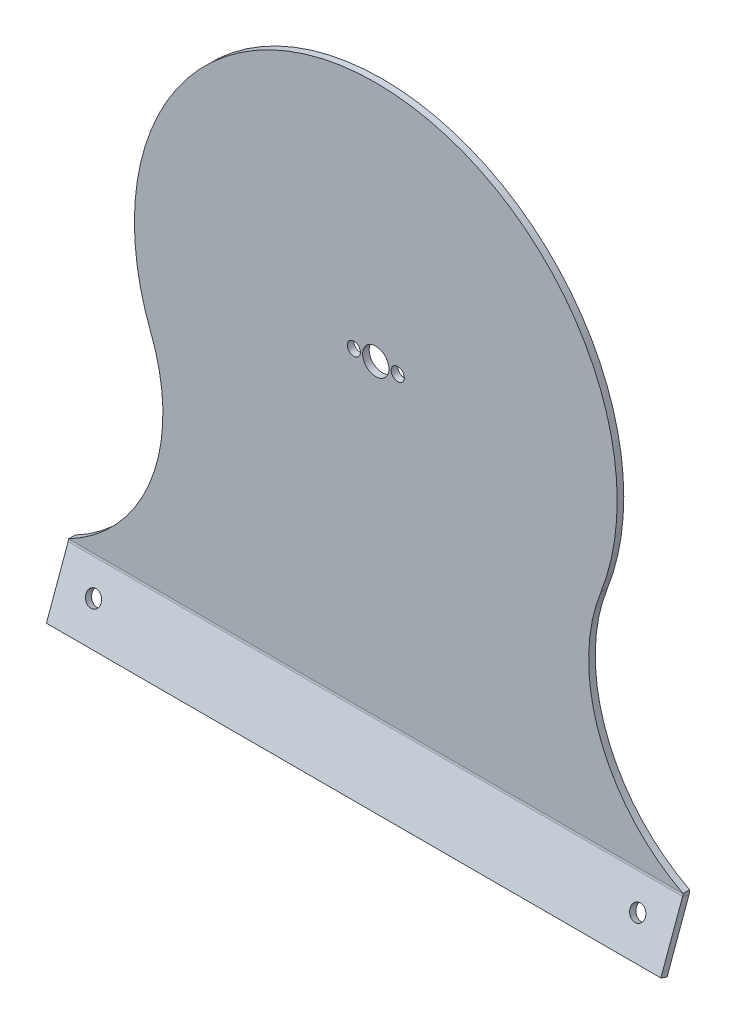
ISO-10303-21;
HEADER;
FILE_DESCRIPTION(('STEP AP214'),'2;1');
FILE_NAME('part.step','',(''),(''),'','','');
FILE_SCHEMA(('AUTOMOTIVE_DESIGN { 1 0 10303 214 1 1 1 1 }'));
ENDSEC;
DATA;
#1=APPLICATION_CONTEXT('core data for automotive mechanical design processes');
#2=APPLICATION_PROTOCOL_DEFINITION('international standard','automotive_design',2000,#1);
#3=PRODUCT_CONTEXT('',#1,'mechanical');
#4=PRODUCT('Part','Part','',(#3));
#5=PRODUCT_RELATED_PRODUCT_CATEGORY('part','',(#4));
#6=PRODUCT_DEFINITION_FORMATION('','',#4);
#7=PRODUCT_DEFINITION_CONTEXT('part definition',#1,'design');
#8=PRODUCT_DEFINITION('design','',#6,#7);
#9=PRODUCT_DEFINITION_SHAPE('','',#8);
#10=(LENGTH_UNIT() NAMED_UNIT(*) SI_UNIT(.MILLI.,.METRE.));
#11=(NAMED_UNIT(*) PLANE_ANGLE_UNIT() SI_UNIT($,.RADIAN.));
#12=(NAMED_UNIT(*) SI_UNIT($,.STERADIAN.) SOLID_ANGLE_UNIT());
#13=UNCERTAINTY_MEASURE_WITH_UNIT(LENGTH_MEASURE(1.E-05),#10,'distance_accuracy_value','');
#14=(GEOMETRIC_REPRESENTATION_CONTEXT(3) GLOBAL_UNCERTAINTY_ASSIGNED_CONTEXT((#13)) GLOBAL_UNIT_ASSIGNED_CONTEXT((#10,
#11,#12)) REPRESENTATION_CONTEXT('',''));
#15=CARTESIAN_POINT('',(0.,0.,0.));
#16=DIRECTION('',(0.,0.,1.));
#17=DIRECTION('',(1.,0.,0.));
#18=AXIS2_PLACEMENT_3D('',#15,#16,#17);
#19=CARTESIAN_POINT('',(70.,-69.1034912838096,1.07743085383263));
#20=DIRECTION('',(1.,0.,0.));
#21=DIRECTION('',(0.,-0.342020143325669,-0.939692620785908));
#22=AXIS2_PLACEMENT_3D('',#19,#20,#21);
#23=PLANE('',#22);
#24=DIRECTION('',(0.,-0.939692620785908,0.342020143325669));
#25=VECTOR('',#24,1.);
#26=CARTESIAN_POINT('',(70.,-69.6165214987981,-0.332108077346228));
#27=LINE('',#26,#25);
#28=CARTESIAN_POINT('',(70.,-71.026060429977,0.180922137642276));
#29=VERTEX_POINT('',#28);
#30=CARTESIAN_POINT('',(70.,-84.6516034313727,5.14021421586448));
#31=VERTEX_POINT('',#30);
#32=EDGE_CURVE('E60',#29,#31,#27,.T.);
#33=ORIENTED_EDGE('',*,*,#32,.F.);
#34=DIRECTION('',(0.,0.342020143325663,0.939692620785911));
#35=VECTOR('',#34,1.);
#36=CARTESIAN_POINT('',(70.,-70.5130302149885,1.59046106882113));
#37=LINE('',#36,#35);
#38=CARTESIAN_POINT('',(70.,-70.5130302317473,1.59046102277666));
#39=VERTEX_POINT('',#38);
#40=EDGE_CURVE('E171',#29,#39,#37,.T.);
#41=ORIENTED_EDGE('',*,*,#40,.T.);
#42=DIRECTION('',(0.,-0.939692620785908,0.342020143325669));
#43=VECTOR('',#42,1.);
#44=CARTESIAN_POINT('',(70.,-69.1034912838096,1.07743085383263));
#45=LINE('',#44,#43);
#46=CARTESIAN_POINT('',(70.,-84.1385732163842,6.54975314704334));
#47=VERTEX_POINT('',#46);
#48=EDGE_CURVE('E40',#39,#47,#45,.T.);
#49=ORIENTED_EDGE('',*,*,#48,.T.);
#50=DIRECTION('',(0.,-0.342020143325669,-0.939692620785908));
#51=VECTOR('',#50,1.);
#52=CARTESIAN_POINT('',(70.,-84.1385732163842,6.54975314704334));
#53=LINE('',#52,#51);
#54=EDGE_CURVE('E164',#47,#31,#53,.T.);
#55=ORIENTED_EDGE('',*,*,#54,.T.);
#56=EDGE_LOOP('',(#33,#41,#49,#55));
#57=FACE_BOUND('',#56,.T.);
#58=ADVANCED_FACE('F36',(#57),#23,.T.);
#59=CARTESIAN_POINT('',(-70.,-84.1385732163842,6.54975314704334));
#60=DIRECTION('',(-1.,0.,0.));
#61=DIRECTION('',(0.,0.342020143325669,0.939692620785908));
#62=AXIS2_PLACEMENT_3D('',#59,#60,#61);
#63=PLANE('',#62);
#64=DIRECTION('',(0.,0.939692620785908,-0.342020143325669));
#65=VECTOR('',#64,1.);
#66=CARTESIAN_POINT('',(-70.,-84.1385732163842,6.54975314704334));
#67=LINE('',#66,#65);
#68=CARTESIAN_POINT('',(-70.,-84.1385732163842,6.54975314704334));
#69=VERTEX_POINT('',#68);
#70=CARTESIAN_POINT('',(-70.,-70.5130302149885,1.59046106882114));
#71=VERTEX_POINT('',#70);
#72=EDGE_CURVE('E160',#69,#71,#67,.T.);
#73=ORIENTED_EDGE('',*,*,#72,.T.);
#74=DIRECTION('',(0.,-0.342020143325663,-0.939692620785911));
#75=VECTOR('',#74,1.);
#76=CARTESIAN_POINT('',(-70.,-70.5130302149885,1.59046106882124));
#77=LINE('',#76,#75);
#78=CARTESIAN_POINT('',(-70.,-71.0260604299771,0.18092213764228));
#79=VERTEX_POINT('',#78);
#80=EDGE_CURVE('E12',#71,#79,#77,.T.);
#81=ORIENTED_EDGE('',*,*,#80,.T.);
#82=DIRECTION('',(0.,0.939692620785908,-0.342020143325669));
#83=VECTOR('',#82,1.);
#84=CARTESIAN_POINT('',(-70.,-84.6516034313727,5.14021421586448));
#85=LINE('',#84,#83);
#86=CARTESIAN_POINT('',(-70.,-84.6516034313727,5.14021421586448));
#87=VERTEX_POINT('',#86);
#88=EDGE_CURVE('E53',#87,#79,#85,.T.);
#89=ORIENTED_EDGE('',*,*,#88,.F.);
#90=DIRECTION('',(0.,-0.342020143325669,-0.939692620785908));
#91=VECTOR('',#90,1.);
#92=CARTESIAN_POINT('',(-70.,-84.1385732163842,6.54975314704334));
#93=LINE('',#92,#91);
#94=EDGE_CURVE('E165',#69,#87,#93,.T.);
#95=ORIENTED_EDGE('',*,*,#94,.F.);
#96=EDGE_LOOP('',(#73,#81,#89,#95));
#97=FACE_BOUND('',#96,.T.);
#98=ADVANCED_FACE('F38',(#97),#63,.T.);
#99=CARTESIAN_POINT('',(-88.5003190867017,-36.2906940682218,-12.4617172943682));
#100=DIRECTION('',(0.,-0.342020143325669,-0.939692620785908));
#101=DIRECTION('',(-1.,0.,0.));
#102=AXIS2_PLACEMENT_3D('',#99,#100,#101);
#103=PLANE('',#102);
#104=CARTESIAN_POINT('',(62.,-77.1340624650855,2.40405306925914));
#105=DIRECTION('',(0.,-0.342020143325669,-0.939692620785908));
#106=DIRECTION('',(-1.,0.,0.));
#107=AXIS2_PLACEMENT_3D('',#104,#105,#106);
#108=CIRCLE('',#107,1.75);
#109=CARTESIAN_POINT('',(60.25,-77.1340624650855,2.40405306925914));
#110=VERTEX_POINT('',#109);
#111=EDGE_CURVE('E146',#110,#110,#108,.T.);
#112=ORIENTED_EDGE('',*,*,#111,.F.);
#113=EDGE_LOOP('',(#112));
#114=FACE_BOUND('',#113,.T.);
#115=CARTESIAN_POINT('',(-62.,-77.1340624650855,2.40405306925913));
#116=DIRECTION('',(0.,-0.342020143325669,-0.939692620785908));
#117=DIRECTION('',(-1.,0.,0.));
#118=AXIS2_PLACEMENT_3D('',#115,#116,#117);
#119=CIRCLE('',#118,1.74999999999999);
#120=CARTESIAN_POINT('',(-63.75,-77.1340624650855,2.40405306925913));
#121=VERTEX_POINT('',#120);
#122=EDGE_CURVE('E152',#121,#121,#119,.T.);
#123=ORIENTED_EDGE('',*,*,#122,.F.);
#124=EDGE_LOOP('',(#123));
#125=FACE_BOUND('',#124,.T.);
#126=ORIENTED_EDGE('',*,*,#88,.T.);
#127=DIRECTION('',(1.,0.,0.));
#128=VECTOR('',#127,1.);
#129=CARTESIAN_POINT('',(-88.5003190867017,-71.0260604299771,0.180922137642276));
#130=LINE('',#129,#128);
#131=EDGE_CURVE('E45',#79,#29,#130,.T.);
#132=ORIENTED_EDGE('',*,*,#131,.T.);
#133=ORIENTED_EDGE('',*,*,#32,.T.);
#134=DIRECTION('',(-1.,0.,0.));
#135=VECTOR('',#134,1.);
#136=CARTESIAN_POINT('',(70.,-84.6516034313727,5.14021421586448));
#137=LINE('',#136,#135);
#138=EDGE_CURVE('E158',#31,#87,#137,.T.);
#139=ORIENTED_EDGE('',*,*,#138,.T.);
#140=EDGE_LOOP('',(#126,#132,#133,#139));
#141=FACE_BOUND('',#140,.T.);
#142=ADVANCED_FACE('F176',(#114,#125,#141),#103,.T.);
#143=CARTESIAN_POINT('',(-88.5003190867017,-35.7776638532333,-11.0521783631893));
#144=DIRECTION('',(0.,-0.342020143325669,-0.939692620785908));
#145=DIRECTION('',(-1.,0.,0.));
#146=AXIS2_PLACEMENT_3D('',#143,#144,#145);
#147=PLANE('',#146);
#148=DIRECTION('',(1.,0.,0.));
#149=VECTOR('',#148,1.);
#150=CARTESIAN_POINT('',(-88.5003190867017,-70.5130302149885,1.59046106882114));
#151=LINE('',#150,#149);
#152=EDGE_CURVE('E167',#71,#39,#151,.T.);
#153=ORIENTED_EDGE('',*,*,#152,.F.);
#154=ORIENTED_EDGE('',*,*,#72,.F.);
#155=DIRECTION('',(-1.,0.,0.));
#156=VECTOR('',#155,1.);
#157=CARTESIAN_POINT('',(70.,-84.1385732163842,6.54975314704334));
#158=LINE('',#157,#156);
#159=EDGE_CURVE('E161',#47,#69,#158,.T.);
#160=ORIENTED_EDGE('',*,*,#159,.F.);
#161=ORIENTED_EDGE('',*,*,#48,.F.);
#162=EDGE_LOOP('',(#153,#154,#160,#161));
#163=FACE_BOUND('',#162,.T.);
#164=CARTESIAN_POINT('',(62.,-76.6210322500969,3.813592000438));
#165=DIRECTION('',(0.,-0.342020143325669,-0.939692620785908));
#166=DIRECTION('',(-1.,0.,0.));
#167=AXIS2_PLACEMENT_3D('',#164,#165,#166);
#168=CIRCLE('',#167,1.75);
#169=CARTESIAN_POINT('',(60.25,-76.6210322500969,3.813592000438));
#170=VERTEX_POINT('',#169);
#171=EDGE_CURVE('E149',#170,#170,#168,.T.);
#172=ORIENTED_EDGE('',*,*,#171,.T.);
#173=EDGE_LOOP('',(#172));
#174=FACE_BOUND('',#173,.T.);
#175=CARTESIAN_POINT('',(-62.,-76.6210322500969,3.81359200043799));
#176=DIRECTION('',(0.,-0.342020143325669,-0.939692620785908));
#177=DIRECTION('',(-1.,0.,0.));
#178=AXIS2_PLACEMENT_3D('',#175,#176,#177);
#179=CIRCLE('',#178,1.74999999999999);
#180=CARTESIAN_POINT('',(-63.75,-76.6210322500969,3.81359200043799));
#181=VERTEX_POINT('',#180);
#182=EDGE_CURVE('E155',#181,#181,#179,.T.);
#183=ORIENTED_EDGE('',*,*,#182,.T.);
#184=EDGE_LOOP('',(#183));
#185=FACE_BOUND('',#184,.T.);
#186=ADVANCED_FACE('F256',(#163,#174,#185),#147,.F.);
#187=CARTESIAN_POINT('',(70.,-84.1385732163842,6.54975314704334));
#188=DIRECTION('',(0.,-0.939692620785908,0.342020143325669));
#189=DIRECTION('',(0.,-0.342020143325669,-0.939692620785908));
#190=AXIS2_PLACEMENT_3D('',#187,#188,#189);
#191=PLANE('',#190);
#192=ORIENTED_EDGE('',*,*,#138,.F.);
#193=ORIENTED_EDGE('',*,*,#54,.F.);
#194=ORIENTED_EDGE('',*,*,#159,.T.);
#195=ORIENTED_EDGE('',*,*,#94,.T.);
#196=EDGE_LOOP('',(#192,#193,#194,#195));
#197=FACE_BOUND('',#196,.T.);
#198=ADVANCED_FACE('F183',(#197),#191,.T.);
#199=CARTESIAN_POINT('',(-62.,-76.6210322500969,3.81359200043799));
#200=DIRECTION('',(0.,-0.342020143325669,-0.939692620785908));
#201=DIRECTION('',(-1.,0.,0.));
#202=AXIS2_PLACEMENT_3D('',#199,#200,#201);
#203=CYLINDRICAL_SURFACE('',#202,1.74999999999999);
#204=ORIENTED_EDGE('',*,*,#182,.F.);
#205=EDGE_LOOP('',(#204));
#206=FACE_BOUND('',#205,.T.);
#207=ORIENTED_EDGE('',*,*,#122,.T.);
#208=EDGE_LOOP('',(#207));
#209=FACE_BOUND('',#208,.T.);
#210=ADVANCED_FACE('F268',(#206,#209),#203,.F.);
#211=CARTESIAN_POINT('',(62.,-76.6210322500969,3.813592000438));
#212=DIRECTION('',(0.,-0.342020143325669,-0.939692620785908));
#213=DIRECTION('',(-1.,0.,0.));
#214=AXIS2_PLACEMENT_3D('',#211,#212,#213);
#215=CYLINDRICAL_SURFACE('',#214,1.75);
#216=ORIENTED_EDGE('',*,*,#171,.F.);
#217=EDGE_LOOP('',(#216));
#218=FACE_BOUND('',#217,.T.);
#219=ORIENTED_EDGE('',*,*,#111,.T.);
#220=EDGE_LOOP('',(#219));
#221=FACE_BOUND('',#220,.T.);
#222=ADVANCED_FACE('F270',(#218,#221),#215,.F.);
#223=CARTESIAN_POINT('',(0.,0.,1.5));
#224=DIRECTION('',(0.,0.,-1.));
#225=DIRECTION('',(-1.,0.,0.));
#226=AXIS2_PLACEMENT_3D('',#223,#224,#225);
#227=CYLINDRICAL_SURFACE('',#226,55.);
#228=CARTESIAN_POINT('',(0.,0.,0.));
#229=DIRECTION('',(0.,0.,1.));
#230=DIRECTION('',(1.,0.,0.));
#231=AXIS2_PLACEMENT_3D('',#228,#229,#230);
#232=CIRCLE('',#231,55.);
#233=CARTESIAN_POINT('',(51.2370268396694,-19.9941761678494,0.));
#234=VERTEX_POINT('',#233);
#235=CARTESIAN_POINT('',(-51.2370268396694,-19.9941761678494,0.));
#236=VERTEX_POINT('',#235);
#237=EDGE_CURVE('E140',#234,#236,#232,.T.);
#238=ORIENTED_EDGE('',*,*,#237,.T.);
#239=DIRECTION('',(0.,0.,-1.));
#240=VECTOR('',#239,1.);
#241=CARTESIAN_POINT('',(-51.2370268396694,-19.9941761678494,1.5));
#242=LINE('',#241,#240);
#243=CARTESIAN_POINT('',(-51.2370268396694,-19.9941761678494,1.5));
#244=VERTEX_POINT('',#243);
#245=EDGE_CURVE('E130',#244,#236,#242,.T.);
#246=ORIENTED_EDGE('',*,*,#245,.F.);
#247=CARTESIAN_POINT('',(0.,0.,1.5));
#248=DIRECTION('',(0.,0.,1.));
#249=DIRECTION('',(1.,0.,0.));
#250=AXIS2_PLACEMENT_3D('',#247,#248,#249);
#251=CIRCLE('',#250,55.);
#252=CARTESIAN_POINT('',(51.2370268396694,-19.9941761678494,1.5));
#253=VERTEX_POINT('',#252);
#254=EDGE_CURVE('E209',#253,#244,#251,.T.);
#255=ORIENTED_EDGE('',*,*,#254,.F.);
#256=DIRECTION('',(0.,0.,-1.));
#257=VECTOR('',#256,1.);
#258=CARTESIAN_POINT('',(51.2370268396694,-19.9941761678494,1.5));
#259=LINE('',#258,#257);
#260=EDGE_CURVE('E142',#253,#234,#259,.T.);
#261=ORIENTED_EDGE('',*,*,#260,.T.);
#262=EDGE_LOOP('',(#238,#246,#255,#261));
#263=FACE_BOUND('',#262,.T.);
#264=ADVANCED_FACE('F228',(#263),#227,.T.);
#265=CARTESIAN_POINT('',(5.,0.,1.5));
#266=DIRECTION('',(0.,0.,-1.));
#267=DIRECTION('',(-1.,0.,0.));
#268=AXIS2_PLACEMENT_3D('',#265,#266,#267);
#269=CYLINDRICAL_SURFACE('',#268,1.5);
#270=CARTESIAN_POINT('',(5.,0.,1.5));
#271=DIRECTION('',(0.,0.,1.));
#272=DIRECTION('',(1.,0.,0.));
#273=AXIS2_PLACEMENT_3D('',#270,#271,#272);
#274=CIRCLE('',#273,1.5);
#275=CARTESIAN_POINT('',(6.5,0.,1.5));
#276=VERTEX_POINT('',#275);
#277=EDGE_CURVE('E222',#276,#276,#274,.T.);
#278=ORIENTED_EDGE('',*,*,#277,.T.);
#279=EDGE_LOOP('',(#278));
#280=FACE_BOUND('',#279,.T.);
#281=CARTESIAN_POINT('',(5.,0.,0.));
#282=DIRECTION('',(0.,0.,1.));
#283=DIRECTION('',(1.,0.,0.));
#284=AXIS2_PLACEMENT_3D('',#281,#282,#283);
#285=CIRCLE('',#284,1.5);
#286=CARTESIAN_POINT('',(6.5,0.,0.));
#287=VERTEX_POINT('',#286);
#288=EDGE_CURVE('E203',#287,#287,#285,.T.);
#289=ORIENTED_EDGE('',*,*,#288,.F.);
#290=EDGE_LOOP('',(#289));
#291=FACE_BOUND('',#290,.T.);
#292=ADVANCED_FACE('F386',(#280,#291),#269,.F.);
#293=CARTESIAN_POINT('',(0.,0.,1.5));
#294=DIRECTION('',(0.,0.,-1.));
#295=DIRECTION('',(-1.,0.,0.));
#296=AXIS2_PLACEMENT_3D('',#293,#294,#295);
#297=CYLINDRICAL_SURFACE('',#296,3.);
#298=CARTESIAN_POINT('',(0.,0.,1.5));
#299=DIRECTION('',(0.,0.,1.));
#300=DIRECTION('',(1.,0.,0.));
#301=AXIS2_PLACEMENT_3D('',#298,#299,#300);
#302=CIRCLE('',#301,3.);
#303=CARTESIAN_POINT('',(3.,0.,1.5));
#304=VERTEX_POINT('',#303);
#305=EDGE_CURVE('E219',#304,#304,#302,.T.);
#306=ORIENTED_EDGE('',*,*,#305,.T.);
#307=EDGE_LOOP('',(#306));
#308=FACE_BOUND('',#307,.T.);
#309=CARTESIAN_POINT('',(0.,0.,0.));
#310=DIRECTION('',(0.,0.,1.));
#311=DIRECTION('',(1.,0.,0.));
#312=AXIS2_PLACEMENT_3D('',#309,#310,#311);
#313=CIRCLE('',#312,3.);
#314=CARTESIAN_POINT('',(3.,0.,0.));
#315=VERTEX_POINT('',#314);
#316=EDGE_CURVE('E200',#315,#315,#313,.T.);
#317=ORIENTED_EDGE('',*,*,#316,.F.);
#318=EDGE_LOOP('',(#317));
#319=FACE_BOUND('',#318,.T.);
#320=ADVANCED_FACE('F245',(#308,#319),#297,.F.);
#321=CARTESIAN_POINT('',(-5.,0.,1.5));
#322=DIRECTION('',(0.,0.,-1.));
#323=DIRECTION('',(-1.,0.,0.));
#324=AXIS2_PLACEMENT_3D('',#321,#322,#323);
#325=CYLINDRICAL_SURFACE('',#324,1.5);
#326=CARTESIAN_POINT('',(-5.,0.,1.5));
#327=DIRECTION('',(0.,0.,1.));
#328=DIRECTION('',(1.,0.,0.));
#329=AXIS2_PLACEMENT_3D('',#326,#327,#328);
#330=CIRCLE('',#329,1.5);
#331=CARTESIAN_POINT('',(-3.5,0.,1.5));
#332=VERTEX_POINT('',#331);
#333=EDGE_CURVE('E216',#332,#332,#330,.T.);
#334=ORIENTED_EDGE('',*,*,#333,.T.);
#335=EDGE_LOOP('',(#334));
#336=FACE_BOUND('',#335,.T.);
#337=CARTESIAN_POINT('',(-5.,0.,0.));
#338=DIRECTION('',(0.,0.,1.));
#339=DIRECTION('',(1.,0.,0.));
#340=AXIS2_PLACEMENT_3D('',#337,#338,#339);
#341=CIRCLE('',#340,1.5);
#342=CARTESIAN_POINT('',(-3.5,0.,0.));
#343=VERTEX_POINT('',#342);
#344=EDGE_CURVE('E133',#343,#343,#341,.T.);
#345=ORIENTED_EDGE('',*,*,#344,.F.);
#346=EDGE_LOOP('',(#345));
#347=FACE_BOUND('',#346,.T.);
#348=ADVANCED_FACE('F237',(#336,#347),#325,.F.);
#349=CARTESIAN_POINT('',(-88.5003190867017,-34.5353951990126,1.5));
#350=DIRECTION('',(0.,0.,-1.));
#351=DIRECTION('',(-1.,0.,0.));
#352=AXIS2_PLACEMENT_3D('',#349,#350,#351);
#353=PLANE('',#352);
#354=ORIENTED_EDGE('',*,*,#333,.F.);
#355=EDGE_LOOP('',(#354));
#356=FACE_BOUND('',#355,.T.);
#357=ORIENTED_EDGE('',*,*,#305,.F.);
#358=EDGE_LOOP('',(#357));
#359=FACE_BOUND('',#358,.T.);
#360=ORIENTED_EDGE('',*,*,#277,.F.);
#361=EDGE_LOOP('',(#360));
#362=FACE_BOUND('',#361,.T.);
#363=CARTESIAN_POINT('',(-88.5003190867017,-34.5353951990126,1.5));
#364=DIRECTION('',(0.,0.,-1.));
#365=DIRECTION('',(-1.,0.,0.));
#366=AXIS2_PLACEMENT_3D('',#363,#364,#365);
#367=CIRCLE('',#366,40.);
#368=CARTESIAN_POINT('',(-70.,-70.,1.499999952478));
#369=VERTEX_POINT('',#368);
#370=EDGE_CURVE('E214',#244,#369,#367,.T.);
#371=ORIENTED_EDGE('',*,*,#370,.T.);
#372=DIRECTION('',(1.,0.,0.));
#373=VECTOR('',#372,1.);
#374=CARTESIAN_POINT('',(-88.5003190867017,-70.,1.5));
#375=LINE('',#374,#373);
#376=CARTESIAN_POINT('',(70.,-70.,1.499999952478));
#377=VERTEX_POINT('',#376);
#378=EDGE_CURVE('E191',#369,#377,#375,.T.);
#379=ORIENTED_EDGE('',*,*,#378,.T.);
#380=CARTESIAN_POINT('',(88.5003190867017,-34.5353951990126,1.5));
#381=DIRECTION('',(0.,0.,-1.));
#382=DIRECTION('',(1.,0.,0.));
#383=AXIS2_PLACEMENT_3D('',#380,#381,#382);
#384=CIRCLE('',#383,40.);
#385=EDGE_CURVE('E211',#377,#253,#384,.T.);
#386=ORIENTED_EDGE('',*,*,#385,.T.);
#387=ORIENTED_EDGE('',*,*,#254,.T.);
#388=EDGE_LOOP('',(#371,#379,#386,#387));
#389=FACE_BOUND('',#388,.T.);
#390=ADVANCED_FACE('F235',(#356,#359,#362,#389),#353,.F.);
#391=CARTESIAN_POINT('',(88.5003190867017,-34.5353951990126,1.5));
#392=DIRECTION('',(0.,0.,-1.));
#393=DIRECTION('',(-1.,0.,0.));
#394=AXIS2_PLACEMENT_3D('',#391,#392,#393);
#395=CYLINDRICAL_SURFACE('',#394,40.);
#396=CARTESIAN_POINT('',(88.5003190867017,-34.5353951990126,0.));
#397=DIRECTION('',(0.,0.,-1.));
#398=DIRECTION('',(1.,0.,0.));
#399=AXIS2_PLACEMENT_3D('',#396,#397,#398);
#400=CIRCLE('',#399,40.);
#401=CARTESIAN_POINT('',(70.,-70.,0.));
#402=VERTEX_POINT('',#401);
#403=EDGE_CURVE('E138',#402,#234,#400,.T.);
#404=ORIENTED_EDGE('',*,*,#403,.T.);
#405=ORIENTED_EDGE('',*,*,#260,.F.);
#406=ORIENTED_EDGE('',*,*,#385,.F.);
#407=DIRECTION('',(0.,0.,-1.));
#408=VECTOR('',#407,1.);
#409=CARTESIAN_POINT('',(70.,-70.,1.5));
#410=LINE('',#409,#408);
#411=EDGE_CURVE('E206',#377,#402,#410,.T.);
#412=ORIENTED_EDGE('',*,*,#411,.T.);
#413=EDGE_LOOP('',(#404,#405,#406,#412));
#414=FACE_BOUND('',#413,.T.);
#415=ADVANCED_FACE('F231',(#414),#395,.F.);
#416=CARTESIAN_POINT('',(-88.5003190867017,-34.5353951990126,0.));
#417=DIRECTION('',(0.,0.,-1.));
#418=DIRECTION('',(-1.,0.,0.));
#419=AXIS2_PLACEMENT_3D('',#416,#417,#418);
#420=PLANE('',#419);
#421=DIRECTION('',(1.,0.,0.));
#422=VECTOR('',#421,1.);
#423=CARTESIAN_POINT('',(-88.5003190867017,-70.,0.));
#424=LINE('',#423,#422);
#425=CARTESIAN_POINT('',(-70.,-70.,-4.89995132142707E-08));
#426=VERTEX_POINT('',#425);
#427=EDGE_CURVE('E114',#426,#402,#424,.T.);
#428=ORIENTED_EDGE('',*,*,#427,.F.);
#429=CARTESIAN_POINT('',(-88.5003190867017,-34.5353951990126,0.));
#430=DIRECTION('',(0.,0.,-1.));
#431=DIRECTION('',(-1.,0.,0.));
#432=AXIS2_PLACEMENT_3D('',#429,#430,#431);
#433=CIRCLE('',#432,40.);
#434=EDGE_CURVE('E127',#236,#426,#433,.T.);
#435=ORIENTED_EDGE('',*,*,#434,.F.);
#436=ORIENTED_EDGE('',*,*,#237,.F.);
#437=ORIENTED_EDGE('',*,*,#403,.F.);
#438=EDGE_LOOP('',(#428,#435,#436,#437));
#439=FACE_BOUND('',#438,.T.);
#440=ORIENTED_EDGE('',*,*,#288,.T.);
#441=EDGE_LOOP('',(#440));
#442=FACE_BOUND('',#441,.T.);
#443=ORIENTED_EDGE('',*,*,#316,.T.);
#444=EDGE_LOOP('',(#443));
#445=FACE_BOUND('',#444,.T.);
#446=ORIENTED_EDGE('',*,*,#344,.T.);
#447=EDGE_LOOP('',(#446));
#448=FACE_BOUND('',#447,.T.);
#449=ADVANCED_FACE('F136',(#439,#442,#445,#448),#420,.T.);
#450=CARTESIAN_POINT('',(-88.5003190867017,-34.5353951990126,1.5));
#451=DIRECTION('',(0.,0.,-1.));
#452=DIRECTION('',(-1.,0.,0.));
#453=AXIS2_PLACEMENT_3D('',#450,#451,#452);
#454=CYLINDRICAL_SURFACE('',#453,40.);
#455=ORIENTED_EDGE('',*,*,#434,.T.);
#456=DIRECTION('',(0.,0.,-1.));
#457=VECTOR('',#456,1.);
#458=CARTESIAN_POINT('',(-70.,-70.,1.5));
#459=LINE('',#458,#457);
#460=EDGE_CURVE('E103',#369,#426,#459,.T.);
#461=ORIENTED_EDGE('',*,*,#460,.F.);
#462=ORIENTED_EDGE('',*,*,#370,.F.);
#463=ORIENTED_EDGE('',*,*,#245,.T.);
#464=EDGE_LOOP('',(#455,#461,#462,#463));
#465=FACE_BOUND('',#464,.T.);
#466=ADVANCED_FACE('F128',(#465),#454,.F.);
#467=CARTESIAN_POINT('',(-70.,-70.,3.00000004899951));
#468=DIRECTION('',(1.,0.,0.));
#469=DIRECTION('',(0.,0.,-1.));
#470=AXIS2_PLACEMENT_3D('',#467,#468,#469);
#471=PLANE('',#470);
#472=ORIENTED_EDGE('',*,*,#460,.T.);
#473=CARTESIAN_POINT('',(-70.,-70.,3.));
#474=DIRECTION('',(1.,0.,0.));
#475=DIRECTION('',(0.,1.,0.));
#476=AXIS2_PLACEMENT_3D('',#473,#474,#475);
#477=CIRCLE('',#476,3.00000004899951);
#478=EDGE_CURVE('E107',#426,#79,#477,.F.);
#479=ORIENTED_EDGE('',*,*,#478,.T.);
#480=ORIENTED_EDGE('',*,*,#80,.F.);
#481=CARTESIAN_POINT('',(-70.,-70.,3.00000004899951));
#482=DIRECTION('',(-1.,0.,0.));
#483=DIRECTION('',(0.,0.,-1.));
#484=AXIS2_PLACEMENT_3D('',#481,#482,#483);
#485=CIRCLE('',#484,1.50000009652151);
#486=EDGE_CURVE('E109',#369,#71,#485,.T.);
#487=ORIENTED_EDGE('',*,*,#486,.F.);
#488=EDGE_LOOP('',(#472,#479,#480,#487));
#489=FACE_BOUND('',#488,.T.);
#490=ADVANCED_FACE('F105',(#489),#471,.F.);
#491=CARTESIAN_POINT('',(70.,-70.,3.00000004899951));
#492=DIRECTION('',(-1.,0.,0.));
#493=DIRECTION('',(0.,0.,1.));
#494=AXIS2_PLACEMENT_3D('',#491,#492,#493);
#495=PLANE('',#494);
#496=ORIENTED_EDGE('',*,*,#40,.F.);
#497=CARTESIAN_POINT('',(70.,-70.,3.));
#498=DIRECTION('',(1.,0.,0.));
#499=DIRECTION('',(0.,1.,0.));
#500=AXIS2_PLACEMENT_3D('',#497,#498,#499);
#501=CIRCLE('',#500,3.00000004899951);
#502=EDGE_CURVE('E123',#29,#402,#501,.T.);
#503=ORIENTED_EDGE('',*,*,#502,.T.);
#504=ORIENTED_EDGE('',*,*,#411,.F.);
#505=CARTESIAN_POINT('',(70.,-70.,3.00000004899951));
#506=DIRECTION('',(1.,0.,0.));
#507=DIRECTION('',(0.,0.,1.));
#508=AXIS2_PLACEMENT_3D('',#505,#506,#507);
#509=CIRCLE('',#508,1.50000009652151);
#510=EDGE_CURVE('E115',#39,#377,#509,.T.);
#511=ORIENTED_EDGE('',*,*,#510,.F.);
#512=EDGE_LOOP('',(#496,#503,#504,#511));
#513=FACE_BOUND('',#512,.T.);
#514=ADVANCED_FACE('F233',(#513),#495,.F.);
#515=CARTESIAN_POINT('',(-140.01607050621,-70.,3.));
#516=DIRECTION('',(1.,0.,0.));
#517=DIRECTION('',(0.,1.,0.));
#518=AXIS2_PLACEMENT_3D('',#515,#516,#517);
#519=CYLINDRICAL_SURFACE('',#518,1.50000004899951);
#520=ORIENTED_EDGE('',*,*,#510,.T.);
#521=ORIENTED_EDGE('',*,*,#378,.F.);
#522=ORIENTED_EDGE('',*,*,#486,.T.);
#523=ORIENTED_EDGE('',*,*,#152,.T.);
#524=EDGE_LOOP('',(#520,#521,#522,#523));
#525=FACE_BOUND('',#524,.T.);
#526=ADVANCED_FACE('F188',(#525),#519,.F.);
#527=CARTESIAN_POINT('',(-140.01607050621,-70.,3.));
#528=DIRECTION('',(1.,0.,0.));
#529=DIRECTION('',(0.,1.,0.));
#530=AXIS2_PLACEMENT_3D('',#527,#528,#529);
#531=CYLINDRICAL_SURFACE('',#530,3.00000004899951);
#532=ORIENTED_EDGE('',*,*,#502,.F.);
#533=ORIENTED_EDGE('',*,*,#131,.F.);
#534=ORIENTED_EDGE('',*,*,#478,.F.);
#535=ORIENTED_EDGE('',*,*,#427,.T.);
#536=EDGE_LOOP('',(#532,#533,#534,#535));
#537=FACE_BOUND('',#536,.T.);
#538=ADVANCED_FACE('F120',(#537),#531,.T.);
#539=CLOSED_SHELL('',(#58,#98,#142,#186,#198,#210,#222,#264,#292,#320,#348,#390,#415,#449,#466,
#490,#514,#526,#538));
#540=MANIFOLD_SOLID_BREP('B2',#539);
#541=ADVANCED_BREP_SHAPE_REPRESENTATION('',(#18,#540),#14);
#542=SHAPE_DEFINITION_REPRESENTATION(#9,#541);
ENDSEC;
END-ISO-10303-21;
